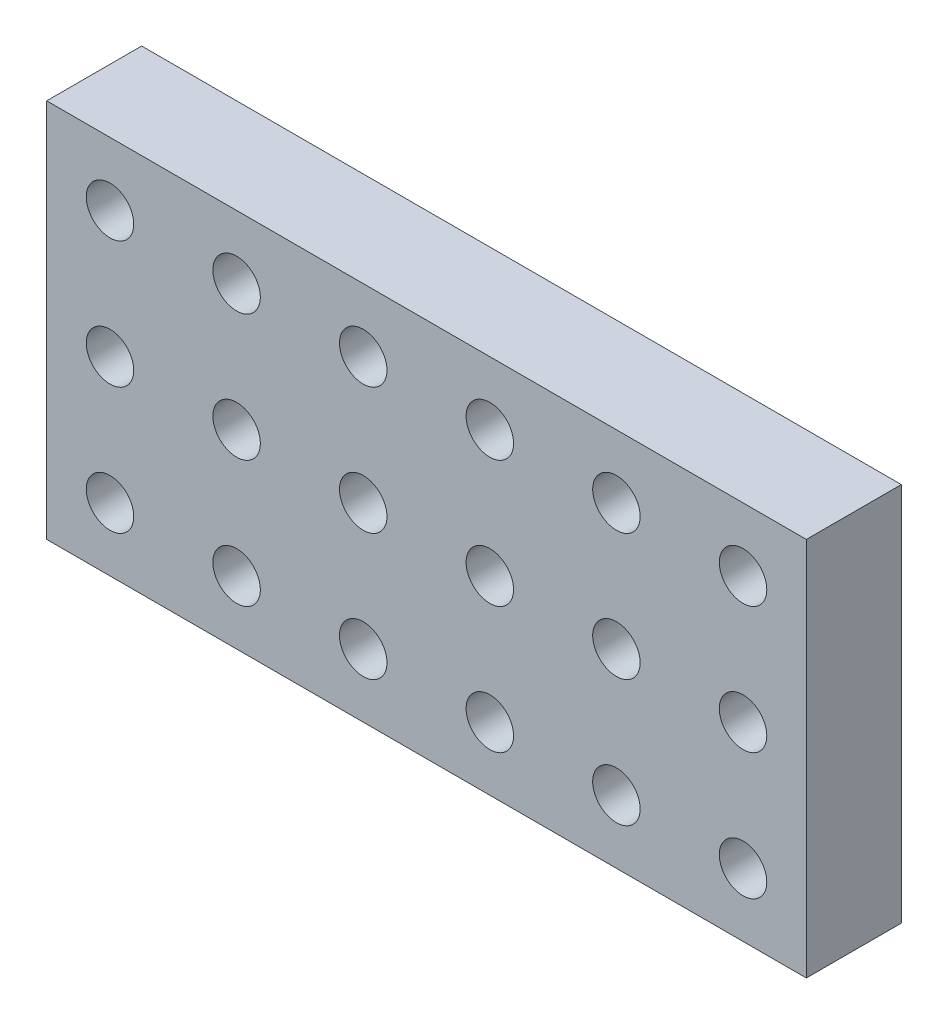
ISO-10303-21;
HEADER;
FILE_DESCRIPTION(('STEP AP214'),'2;1');
FILE_NAME('part.step','',(''),(''),'','','');
FILE_SCHEMA(('AUTOMOTIVE_DESIGN { 1 0 10303 214 1 1 1 1 }'));
ENDSEC;
DATA;
#1=APPLICATION_CONTEXT('core data for automotive mechanical design processes');
#2=APPLICATION_PROTOCOL_DEFINITION('international standard','automotive_design',2000,#1);
#3=PRODUCT_CONTEXT('',#1,'mechanical');
#4=PRODUCT('Part','Part','',(#3));
#5=PRODUCT_RELATED_PRODUCT_CATEGORY('part','',(#4));
#6=PRODUCT_DEFINITION_FORMATION('','',#4);
#7=PRODUCT_DEFINITION_CONTEXT('part definition',#1,'design');
#8=PRODUCT_DEFINITION('design','',#6,#7);
#9=PRODUCT_DEFINITION_SHAPE('','',#8);
#10=(LENGTH_UNIT() NAMED_UNIT(*) SI_UNIT(.MILLI.,.METRE.));
#11=(NAMED_UNIT(*) PLANE_ANGLE_UNIT() SI_UNIT($,.RADIAN.));
#12=(NAMED_UNIT(*) SI_UNIT($,.STERADIAN.) SOLID_ANGLE_UNIT());
#13=UNCERTAINTY_MEASURE_WITH_UNIT(LENGTH_MEASURE(1.E-05),#10,'distance_accuracy_value','');
#14=(GEOMETRIC_REPRESENTATION_CONTEXT(3) GLOBAL_UNCERTAINTY_ASSIGNED_CONTEXT((#13)) GLOBAL_UNIT_ASSIGNED_CONTEXT((#10,
#11,#12)) REPRESENTATION_CONTEXT('',''));
#15=CARTESIAN_POINT('',(0.,0.,0.));
#16=DIRECTION('',(0.,0.,1.));
#17=DIRECTION('',(1.,0.,0.));
#18=AXIS2_PLACEMENT_3D('',#15,#16,#17);
#19=CARTESIAN_POINT('',(-120.,-60.,30.));
#20=DIRECTION('',(1.,0.,0.));
#21=DIRECTION('',(0.,0.,-1.));
#22=AXIS2_PLACEMENT_3D('',#19,#20,#21);
#23=PLANE('',#22);
#24=DIRECTION('',(0.,-1.,0.));
#25=VECTOR('',#24,1.);
#26=CARTESIAN_POINT('',(-120.,-60.,0.));
#27=LINE('',#26,#25);
#28=CARTESIAN_POINT('',(-120.,60.,0.));
#29=VERTEX_POINT('',#28);
#30=CARTESIAN_POINT('',(-120.,-60.,0.));
#31=VERTEX_POINT('',#30);
#32=EDGE_CURVE('E392',#29,#31,#27,.T.);
#33=ORIENTED_EDGE('',*,*,#32,.T.);
#34=DIRECTION('',(0.,0.,-1.));
#35=VECTOR('',#34,1.);
#36=CARTESIAN_POINT('',(-120.,-60.,30.));
#37=LINE('',#36,#35);
#38=CARTESIAN_POINT('',(-120.,-60.,30.));
#39=VERTEX_POINT('',#38);
#40=EDGE_CURVE('E11',#39,#31,#37,.T.);
#41=ORIENTED_EDGE('',*,*,#40,.F.);
#42=DIRECTION('',(0.,-1.,0.));
#43=VECTOR('',#42,1.);
#44=CARTESIAN_POINT('',(-120.,-60.,30.));
#45=LINE('',#44,#43);
#46=CARTESIAN_POINT('',(-120.,60.,30.));
#47=VERTEX_POINT('',#46);
#48=EDGE_CURVE('E415',#47,#39,#45,.T.);
#49=ORIENTED_EDGE('',*,*,#48,.F.);
#50=DIRECTION('',(0.,0.,-1.));
#51=VECTOR('',#50,1.);
#52=CARTESIAN_POINT('',(-120.,60.,30.));
#53=LINE('',#52,#51);
#54=EDGE_CURVE('E404',#47,#29,#53,.T.);
#55=ORIENTED_EDGE('',*,*,#54,.T.);
#56=EDGE_LOOP('',(#33,#41,#49,#55));
#57=FACE_BOUND('',#56,.T.);
#58=ADVANCED_FACE('F348',(#57),#23,.F.);
#59=CARTESIAN_POINT('',(-120.,-60.,30.));
#60=DIRECTION('',(0.,1.,0.));
#61=DIRECTION('',(0.,0.,1.));
#62=AXIS2_PLACEMENT_3D('',#59,#60,#61);
#63=PLANE('',#62);
#64=DIRECTION('',(1.,0.,0.));
#65=VECTOR('',#64,1.);
#66=CARTESIAN_POINT('',(-120.,-60.,0.));
#67=LINE('',#66,#65);
#68=CARTESIAN_POINT('',(120.,-60.,0.));
#69=VERTEX_POINT('',#68);
#70=EDGE_CURVE('E388',#31,#69,#67,.T.);
#71=ORIENTED_EDGE('',*,*,#70,.T.);
#72=DIRECTION('',(0.,0.,-1.));
#73=VECTOR('',#72,1.);
#74=CARTESIAN_POINT('',(120.,-60.,30.));
#75=LINE('',#74,#73);
#76=CARTESIAN_POINT('',(120.,-60.,30.));
#77=VERTEX_POINT('',#76);
#78=EDGE_CURVE('E355',#77,#69,#75,.T.);
#79=ORIENTED_EDGE('',*,*,#78,.F.);
#80=DIRECTION('',(1.,0.,0.));
#81=VECTOR('',#80,1.);
#82=CARTESIAN_POINT('',(-120.,-60.,30.));
#83=LINE('',#82,#81);
#84=EDGE_CURVE('E400',#39,#77,#83,.T.);
#85=ORIENTED_EDGE('',*,*,#84,.F.);
#86=ORIENTED_EDGE('',*,*,#40,.T.);
#87=EDGE_LOOP('',(#71,#79,#85,#86));
#88=FACE_BOUND('',#87,.T.);
#89=ADVANCED_FACE('F399',(#88),#63,.F.);
#90=CARTESIAN_POINT('',(120.,-60.,30.));
#91=DIRECTION('',(-1.,0.,0.));
#92=DIRECTION('',(0.,0.,1.));
#93=AXIS2_PLACEMENT_3D('',#90,#91,#92);
#94=PLANE('',#93);
#95=DIRECTION('',(0.,1.,0.));
#96=VECTOR('',#95,1.);
#97=CARTESIAN_POINT('',(120.,-60.,0.));
#98=LINE('',#97,#96);
#99=CARTESIAN_POINT('',(120.,60.,0.));
#100=VERTEX_POINT('',#99);
#101=EDGE_CURVE('E393',#69,#100,#98,.T.);
#102=ORIENTED_EDGE('',*,*,#101,.T.);
#103=DIRECTION('',(0.,0.,-1.));
#104=VECTOR('',#103,1.);
#105=CARTESIAN_POINT('',(120.,60.,30.));
#106=LINE('',#105,#104);
#107=CARTESIAN_POINT('',(120.,60.,30.));
#108=VERTEX_POINT('',#107);
#109=EDGE_CURVE('E421',#108,#100,#106,.T.);
#110=ORIENTED_EDGE('',*,*,#109,.F.);
#111=DIRECTION('',(0.,1.,0.));
#112=VECTOR('',#111,1.);
#113=CARTESIAN_POINT('',(120.,-60.,30.));
#114=LINE('',#113,#112);
#115=EDGE_CURVE('E367',#77,#108,#114,.T.);
#116=ORIENTED_EDGE('',*,*,#115,.F.);
#117=ORIENTED_EDGE('',*,*,#78,.T.);
#118=EDGE_LOOP('',(#102,#110,#116,#117));
#119=FACE_BOUND('',#118,.T.);
#120=ADVANCED_FACE('F424',(#119),#94,.F.);
#121=CARTESIAN_POINT('',(-120.,60.,30.));
#122=DIRECTION('',(0.,-1.,0.));
#123=DIRECTION('',(0.,0.,-1.));
#124=AXIS2_PLACEMENT_3D('',#121,#122,#123);
#125=PLANE('',#124);
#126=DIRECTION('',(-1.,0.,0.));
#127=VECTOR('',#126,1.);
#128=CARTESIAN_POINT('',(-120.,60.,0.));
#129=LINE('',#128,#127);
#130=EDGE_CURVE('E413',#100,#29,#129,.T.);
#131=ORIENTED_EDGE('',*,*,#130,.T.);
#132=ORIENTED_EDGE('',*,*,#54,.F.);
#133=DIRECTION('',(-1.,0.,0.));
#134=VECTOR('',#133,1.);
#135=CARTESIAN_POINT('',(-120.,60.,30.));
#136=LINE('',#135,#134);
#137=EDGE_CURVE('E362',#108,#47,#136,.T.);
#138=ORIENTED_EDGE('',*,*,#137,.F.);
#139=ORIENTED_EDGE('',*,*,#109,.T.);
#140=EDGE_LOOP('',(#131,#132,#138,#139));
#141=FACE_BOUND('',#140,.T.);
#142=ADVANCED_FACE('F426',(#141),#125,.F.);
#143=CARTESIAN_POINT('',(-120.,60.,30.));
#144=DIRECTION('',(0.,0.,-1.));
#145=DIRECTION('',(-1.,0.,0.));
#146=AXIS2_PLACEMENT_3D('',#143,#144,#145);
#147=PLANE('',#146);
#148=CARTESIAN_POINT('',(100.000000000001,-40.,30.));
#149=DIRECTION('',(0.,0.,1.));
#150=DIRECTION('',(1.,0.,0.));
#151=AXIS2_PLACEMENT_3D('',#148,#149,#150);
#152=CIRCLE('',#151,7.50000000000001);
#153=CARTESIAN_POINT('',(107.500000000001,-40.,30.));
#154=VERTEX_POINT('',#153);
#155=EDGE_CURVE('E611',#154,#154,#152,.T.);
#156=ORIENTED_EDGE('',*,*,#155,.F.);
#157=EDGE_LOOP('',(#156));
#158=FACE_BOUND('',#157,.T.);
#159=CARTESIAN_POINT('',(60.0000000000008,-40.,30.));
#160=DIRECTION('',(0.,0.,1.));
#161=DIRECTION('',(1.,0.,0.));
#162=AXIS2_PLACEMENT_3D('',#159,#160,#161);
#163=CIRCLE('',#162,7.50000000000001);
#164=CARTESIAN_POINT('',(67.5000000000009,-40.,30.));
#165=VERTEX_POINT('',#164);
#166=EDGE_CURVE('E615',#165,#165,#163,.T.);
#167=ORIENTED_EDGE('',*,*,#166,.F.);
#168=EDGE_LOOP('',(#167));
#169=FACE_BOUND('',#168,.T.);
#170=CARTESIAN_POINT('',(20.0000000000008,-40.,30.));
#171=DIRECTION('',(0.,0.,1.));
#172=DIRECTION('',(1.,0.,0.));
#173=AXIS2_PLACEMENT_3D('',#170,#171,#172);
#174=CIRCLE('',#173,7.50000000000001);
#175=CARTESIAN_POINT('',(27.5000000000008,-40.,30.));
#176=VERTEX_POINT('',#175);
#177=EDGE_CURVE('E622',#176,#176,#174,.T.);
#178=ORIENTED_EDGE('',*,*,#177,.F.);
#179=EDGE_LOOP('',(#178));
#180=FACE_BOUND('',#179,.T.);
#181=CARTESIAN_POINT('',(-19.9999999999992,-40.,30.));
#182=DIRECTION('',(0.,0.,1.));
#183=DIRECTION('',(1.,0.,0.));
#184=AXIS2_PLACEMENT_3D('',#181,#182,#183);
#185=CIRCLE('',#184,7.50000000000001);
#186=CARTESIAN_POINT('',(-12.4999999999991,-40.,30.));
#187=VERTEX_POINT('',#186);
#188=EDGE_CURVE('E628',#187,#187,#185,.T.);
#189=ORIENTED_EDGE('',*,*,#188,.F.);
#190=EDGE_LOOP('',(#189));
#191=FACE_BOUND('',#190,.T.);
#192=CARTESIAN_POINT('',(-59.9999999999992,-40.,30.));
#193=DIRECTION('',(0.,0.,1.));
#194=DIRECTION('',(1.,0.,0.));
#195=AXIS2_PLACEMENT_3D('',#192,#193,#194);
#196=CIRCLE('',#195,7.50000000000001);
#197=CARTESIAN_POINT('',(-52.4999999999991,-40.,30.));
#198=VERTEX_POINT('',#197);
#199=EDGE_CURVE('E634',#198,#198,#196,.T.);
#200=ORIENTED_EDGE('',*,*,#199,.F.);
#201=EDGE_LOOP('',(#200));
#202=FACE_BOUND('',#201,.T.);
#203=CARTESIAN_POINT('',(-99.9999999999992,-40.,30.));
#204=DIRECTION('',(0.,0.,1.));
#205=DIRECTION('',(1.,0.,0.));
#206=AXIS2_PLACEMENT_3D('',#203,#204,#205);
#207=CIRCLE('',#206,7.50000000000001);
#208=CARTESIAN_POINT('',(-92.4999999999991,-40.,30.));
#209=VERTEX_POINT('',#208);
#210=EDGE_CURVE('E640',#209,#209,#207,.T.);
#211=ORIENTED_EDGE('',*,*,#210,.F.);
#212=EDGE_LOOP('',(#211));
#213=FACE_BOUND('',#212,.T.);
#214=CARTESIAN_POINT('',(100.,0.,30.));
#215=DIRECTION('',(0.,0.,1.));
#216=DIRECTION('',(1.,0.,0.));
#217=AXIS2_PLACEMENT_3D('',#214,#215,#216);
#218=CIRCLE('',#217,7.50000000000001);
#219=CARTESIAN_POINT('',(107.5,0.,30.));
#220=VERTEX_POINT('',#219);
#221=EDGE_CURVE('E646',#220,#220,#218,.T.);
#222=ORIENTED_EDGE('',*,*,#221,.F.);
#223=EDGE_LOOP('',(#222));
#224=FACE_BOUND('',#223,.T.);
#225=CARTESIAN_POINT('',(60.0000000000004,0.,30.));
#226=DIRECTION('',(0.,0.,1.));
#227=DIRECTION('',(1.,0.,0.));
#228=AXIS2_PLACEMENT_3D('',#225,#226,#227);
#229=CIRCLE('',#228,7.50000000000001);
#230=CARTESIAN_POINT('',(67.5000000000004,0.,30.));
#231=VERTEX_POINT('',#230);
#232=EDGE_CURVE('E652',#231,#231,#229,.T.);
#233=ORIENTED_EDGE('',*,*,#232,.F.);
#234=EDGE_LOOP('',(#233));
#235=FACE_BOUND('',#234,.T.);
#236=CARTESIAN_POINT('',(20.0000000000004,0.,30.));
#237=DIRECTION('',(0.,0.,1.));
#238=DIRECTION('',(1.,0.,0.));
#239=AXIS2_PLACEMENT_3D('',#236,#237,#238);
#240=CIRCLE('',#239,7.50000000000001);
#241=CARTESIAN_POINT('',(27.5000000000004,0.,30.));
#242=VERTEX_POINT('',#241);
#243=EDGE_CURVE('E658',#242,#242,#240,.T.);
#244=ORIENTED_EDGE('',*,*,#243,.F.);
#245=EDGE_LOOP('',(#244));
#246=FACE_BOUND('',#245,.T.);
#247=CARTESIAN_POINT('',(-19.9999999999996,0.,30.));
#248=DIRECTION('',(0.,0.,1.));
#249=DIRECTION('',(1.,0.,0.));
#250=AXIS2_PLACEMENT_3D('',#247,#248,#249);
#251=CIRCLE('',#250,7.50000000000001);
#252=CARTESIAN_POINT('',(-12.4999999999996,0.,30.));
#253=VERTEX_POINT('',#252);
#254=EDGE_CURVE('E664',#253,#253,#251,.T.);
#255=ORIENTED_EDGE('',*,*,#254,.F.);
#256=EDGE_LOOP('',(#255));
#257=FACE_BOUND('',#256,.T.);
#258=CARTESIAN_POINT('',(-59.9999999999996,0.,30.));
#259=DIRECTION('',(0.,0.,1.));
#260=DIRECTION('',(1.,0.,0.));
#261=AXIS2_PLACEMENT_3D('',#258,#259,#260);
#262=CIRCLE('',#261,7.50000000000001);
#263=CARTESIAN_POINT('',(-52.4999999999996,0.,30.));
#264=VERTEX_POINT('',#263);
#265=EDGE_CURVE('E670',#264,#264,#262,.T.);
#266=ORIENTED_EDGE('',*,*,#265,.F.);
#267=EDGE_LOOP('',(#266));
#268=FACE_BOUND('',#267,.T.);
#269=CARTESIAN_POINT('',(-99.9999999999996,0.,30.));
#270=DIRECTION('',(0.,0.,1.));
#271=DIRECTION('',(1.,0.,0.));
#272=AXIS2_PLACEMENT_3D('',#269,#270,#271);
#273=CIRCLE('',#272,7.50000000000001);
#274=CARTESIAN_POINT('',(-92.4999999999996,0.,30.));
#275=VERTEX_POINT('',#274);
#276=EDGE_CURVE('E676',#275,#275,#273,.T.);
#277=ORIENTED_EDGE('',*,*,#276,.F.);
#278=EDGE_LOOP('',(#277));
#279=FACE_BOUND('',#278,.T.);
#280=CARTESIAN_POINT('',(100.,40.,30.));
#281=DIRECTION('',(0.,0.,1.));
#282=DIRECTION('',(1.,0.,0.));
#283=AXIS2_PLACEMENT_3D('',#280,#281,#282);
#284=CIRCLE('',#283,7.50000000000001);
#285=CARTESIAN_POINT('',(107.5,40.,30.));
#286=VERTEX_POINT('',#285);
#287=EDGE_CURVE('E682',#286,#286,#284,.T.);
#288=ORIENTED_EDGE('',*,*,#287,.F.);
#289=EDGE_LOOP('',(#288));
#290=FACE_BOUND('',#289,.T.);
#291=CARTESIAN_POINT('',(60.,40.,30.));
#292=DIRECTION('',(0.,0.,1.));
#293=DIRECTION('',(1.,0.,0.));
#294=AXIS2_PLACEMENT_3D('',#291,#292,#293);
#295=CIRCLE('',#294,7.50000000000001);
#296=CARTESIAN_POINT('',(67.5,40.,30.));
#297=VERTEX_POINT('',#296);
#298=EDGE_CURVE('E688',#297,#297,#295,.T.);
#299=ORIENTED_EDGE('',*,*,#298,.F.);
#300=EDGE_LOOP('',(#299));
#301=FACE_BOUND('',#300,.T.);
#302=CARTESIAN_POINT('',(20.,40.,30.));
#303=DIRECTION('',(0.,0.,1.));
#304=DIRECTION('',(1.,0.,0.));
#305=AXIS2_PLACEMENT_3D('',#302,#303,#304);
#306=CIRCLE('',#305,7.50000000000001);
#307=CARTESIAN_POINT('',(27.5,40.,30.));
#308=VERTEX_POINT('',#307);
#309=EDGE_CURVE('E694',#308,#308,#306,.T.);
#310=ORIENTED_EDGE('',*,*,#309,.F.);
#311=EDGE_LOOP('',(#310));
#312=FACE_BOUND('',#311,.T.);
#313=CARTESIAN_POINT('',(-20.,40.,30.));
#314=DIRECTION('',(0.,0.,1.));
#315=DIRECTION('',(1.,0.,0.));
#316=AXIS2_PLACEMENT_3D('',#313,#314,#315);
#317=CIRCLE('',#316,7.50000000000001);
#318=CARTESIAN_POINT('',(-12.5,40.,30.));
#319=VERTEX_POINT('',#318);
#320=EDGE_CURVE('E700',#319,#319,#317,.T.);
#321=ORIENTED_EDGE('',*,*,#320,.F.);
#322=EDGE_LOOP('',(#321));
#323=FACE_BOUND('',#322,.T.);
#324=CARTESIAN_POINT('',(-60.,40.,30.));
#325=DIRECTION('',(0.,0.,1.));
#326=DIRECTION('',(1.,0.,0.));
#327=AXIS2_PLACEMENT_3D('',#324,#325,#326);
#328=CIRCLE('',#327,7.50000000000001);
#329=CARTESIAN_POINT('',(-52.5,40.,30.));
#330=VERTEX_POINT('',#329);
#331=EDGE_CURVE('E706',#330,#330,#328,.T.);
#332=ORIENTED_EDGE('',*,*,#331,.F.);
#333=EDGE_LOOP('',(#332));
#334=FACE_BOUND('',#333,.T.);
#335=CARTESIAN_POINT('',(-100.,40.,30.));
#336=DIRECTION('',(0.,0.,1.));
#337=DIRECTION('',(1.,0.,0.));
#338=AXIS2_PLACEMENT_3D('',#335,#336,#337);
#339=CIRCLE('',#338,7.50000000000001);
#340=CARTESIAN_POINT('',(-92.5,40.,30.));
#341=VERTEX_POINT('',#340);
#342=EDGE_CURVE('E405',#341,#341,#339,.T.);
#343=ORIENTED_EDGE('',*,*,#342,.F.);
#344=EDGE_LOOP('',(#343));
#345=FACE_BOUND('',#344,.T.);
#346=ORIENTED_EDGE('',*,*,#48,.T.);
#347=ORIENTED_EDGE('',*,*,#84,.T.);
#348=ORIENTED_EDGE('',*,*,#115,.T.);
#349=ORIENTED_EDGE('',*,*,#137,.T.);
#350=EDGE_LOOP('',(#346,#347,#348,#349));
#351=FACE_BOUND('',#350,.T.);
#352=ADVANCED_FACE('F427',(#158,#169,#180,#191,#202,#213,#224,#235,#246,#257,#268,#279,#290,
#301,#312,#323,#334,#345,#351),#147,.F.);
#353=CARTESIAN_POINT('',(-120.,60.,0.));
#354=DIRECTION('',(0.,0.,-1.));
#355=DIRECTION('',(-1.,0.,0.));
#356=AXIS2_PLACEMENT_3D('',#353,#354,#355);
#357=PLANE('',#356);
#358=CARTESIAN_POINT('',(100.000000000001,-40.,0.));
#359=DIRECTION('',(0.,0.,-1.));
#360=DIRECTION('',(-1.,0.,0.));
#361=AXIS2_PLACEMENT_3D('',#358,#359,#360);
#362=CIRCLE('',#361,7.50000000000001);
#363=CARTESIAN_POINT('',(92.5000000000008,-40.,0.));
#364=VERTEX_POINT('',#363);
#365=EDGE_CURVE('E609',#364,#364,#362,.F.);
#366=ORIENTED_EDGE('',*,*,#365,.T.);
#367=EDGE_LOOP('',(#366));
#368=FACE_BOUND('',#367,.T.);
#369=CARTESIAN_POINT('',(60.0000000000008,-40.,0.));
#370=DIRECTION('',(0.,0.,-1.));
#371=DIRECTION('',(-1.,0.,0.));
#372=AXIS2_PLACEMENT_3D('',#369,#370,#371);
#373=CIRCLE('',#372,7.50000000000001);
#374=CARTESIAN_POINT('',(52.5000000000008,-40.,0.));
#375=VERTEX_POINT('',#374);
#376=EDGE_CURVE('E612',#375,#375,#373,.F.);
#377=ORIENTED_EDGE('',*,*,#376,.T.);
#378=EDGE_LOOP('',(#377));
#379=FACE_BOUND('',#378,.T.);
#380=CARTESIAN_POINT('',(20.0000000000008,-40.,0.));
#381=DIRECTION('',(0.,0.,-1.));
#382=DIRECTION('',(-1.,0.,0.));
#383=AXIS2_PLACEMENT_3D('',#380,#381,#382);
#384=CIRCLE('',#383,7.50000000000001);
#385=CARTESIAN_POINT('',(12.5000000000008,-40.,0.));
#386=VERTEX_POINT('',#385);
#387=EDGE_CURVE('E620',#386,#386,#384,.F.);
#388=ORIENTED_EDGE('',*,*,#387,.T.);
#389=EDGE_LOOP('',(#388));
#390=FACE_BOUND('',#389,.T.);
#391=CARTESIAN_POINT('',(-19.9999999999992,-40.,0.));
#392=DIRECTION('',(0.,0.,-1.));
#393=DIRECTION('',(-1.,0.,0.));
#394=AXIS2_PLACEMENT_3D('',#391,#392,#393);
#395=CIRCLE('',#394,7.50000000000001);
#396=CARTESIAN_POINT('',(-27.4999999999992,-40.,0.));
#397=VERTEX_POINT('',#396);
#398=EDGE_CURVE('E625',#397,#397,#395,.F.);
#399=ORIENTED_EDGE('',*,*,#398,.T.);
#400=EDGE_LOOP('',(#399));
#401=FACE_BOUND('',#400,.T.);
#402=CARTESIAN_POINT('',(-59.9999999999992,-40.,0.));
#403=DIRECTION('',(0.,0.,-1.));
#404=DIRECTION('',(-1.,0.,0.));
#405=AXIS2_PLACEMENT_3D('',#402,#403,#404);
#406=CIRCLE('',#405,7.50000000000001);
#407=CARTESIAN_POINT('',(-67.4999999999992,-40.,0.));
#408=VERTEX_POINT('',#407);
#409=EDGE_CURVE('E631',#408,#408,#406,.F.);
#410=ORIENTED_EDGE('',*,*,#409,.T.);
#411=EDGE_LOOP('',(#410));
#412=FACE_BOUND('',#411,.T.);
#413=CARTESIAN_POINT('',(-99.9999999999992,-40.,0.));
#414=DIRECTION('',(0.,0.,-1.));
#415=DIRECTION('',(-1.,0.,0.));
#416=AXIS2_PLACEMENT_3D('',#413,#414,#415);
#417=CIRCLE('',#416,7.50000000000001);
#418=CARTESIAN_POINT('',(-107.499999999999,-40.,0.));
#419=VERTEX_POINT('',#418);
#420=EDGE_CURVE('E637',#419,#419,#417,.F.);
#421=ORIENTED_EDGE('',*,*,#420,.T.);
#422=EDGE_LOOP('',(#421));
#423=FACE_BOUND('',#422,.T.);
#424=CARTESIAN_POINT('',(100.,0.,0.));
#425=DIRECTION('',(0.,0.,-1.));
#426=DIRECTION('',(-1.,0.,0.));
#427=AXIS2_PLACEMENT_3D('',#424,#425,#426);
#428=CIRCLE('',#427,7.50000000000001);
#429=CARTESIAN_POINT('',(92.5000000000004,0.,0.));
#430=VERTEX_POINT('',#429);
#431=EDGE_CURVE('E643',#430,#430,#428,.F.);
#432=ORIENTED_EDGE('',*,*,#431,.T.);
#433=EDGE_LOOP('',(#432));
#434=FACE_BOUND('',#433,.T.);
#435=CARTESIAN_POINT('',(60.0000000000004,0.,0.));
#436=DIRECTION('',(0.,0.,-1.));
#437=DIRECTION('',(-1.,0.,0.));
#438=AXIS2_PLACEMENT_3D('',#435,#436,#437);
#439=CIRCLE('',#438,7.50000000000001);
#440=CARTESIAN_POINT('',(52.5000000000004,0.,0.));
#441=VERTEX_POINT('',#440);
#442=EDGE_CURVE('E649',#441,#441,#439,.F.);
#443=ORIENTED_EDGE('',*,*,#442,.T.);
#444=EDGE_LOOP('',(#443));
#445=FACE_BOUND('',#444,.T.);
#446=CARTESIAN_POINT('',(20.0000000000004,0.,0.));
#447=DIRECTION('',(0.,0.,-1.));
#448=DIRECTION('',(-1.,0.,0.));
#449=AXIS2_PLACEMENT_3D('',#446,#447,#448);
#450=CIRCLE('',#449,7.50000000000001);
#451=CARTESIAN_POINT('',(12.5000000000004,0.,0.));
#452=VERTEX_POINT('',#451);
#453=EDGE_CURVE('E655',#452,#452,#450,.F.);
#454=ORIENTED_EDGE('',*,*,#453,.T.);
#455=EDGE_LOOP('',(#454));
#456=FACE_BOUND('',#455,.T.);
#457=CARTESIAN_POINT('',(-19.9999999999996,0.,0.));
#458=DIRECTION('',(0.,0.,-1.));
#459=DIRECTION('',(-1.,0.,0.));
#460=AXIS2_PLACEMENT_3D('',#457,#458,#459);
#461=CIRCLE('',#460,7.50000000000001);
#462=CARTESIAN_POINT('',(-27.4999999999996,0.,0.));
#463=VERTEX_POINT('',#462);
#464=EDGE_CURVE('E661',#463,#463,#461,.F.);
#465=ORIENTED_EDGE('',*,*,#464,.T.);
#466=EDGE_LOOP('',(#465));
#467=FACE_BOUND('',#466,.T.);
#468=CARTESIAN_POINT('',(-59.9999999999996,0.,0.));
#469=DIRECTION('',(0.,0.,-1.));
#470=DIRECTION('',(-1.,0.,0.));
#471=AXIS2_PLACEMENT_3D('',#468,#469,#470);
#472=CIRCLE('',#471,7.50000000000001);
#473=CARTESIAN_POINT('',(-67.4999999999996,0.,0.));
#474=VERTEX_POINT('',#473);
#475=EDGE_CURVE('E667',#474,#474,#472,.F.);
#476=ORIENTED_EDGE('',*,*,#475,.T.);
#477=EDGE_LOOP('',(#476));
#478=FACE_BOUND('',#477,.T.);
#479=CARTESIAN_POINT('',(-99.9999999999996,0.,0.));
#480=DIRECTION('',(0.,0.,-1.));
#481=DIRECTION('',(-1.,0.,0.));
#482=AXIS2_PLACEMENT_3D('',#479,#480,#481);
#483=CIRCLE('',#482,7.50000000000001);
#484=CARTESIAN_POINT('',(-107.5,0.,0.));
#485=VERTEX_POINT('',#484);
#486=EDGE_CURVE('E673',#485,#485,#483,.F.);
#487=ORIENTED_EDGE('',*,*,#486,.T.);
#488=EDGE_LOOP('',(#487));
#489=FACE_BOUND('',#488,.T.);
#490=CARTESIAN_POINT('',(100.,40.,0.));
#491=DIRECTION('',(0.,0.,-1.));
#492=DIRECTION('',(-1.,0.,0.));
#493=AXIS2_PLACEMENT_3D('',#490,#491,#492);
#494=CIRCLE('',#493,7.50000000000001);
#495=CARTESIAN_POINT('',(92.5,40.,0.));
#496=VERTEX_POINT('',#495);
#497=EDGE_CURVE('E679',#496,#496,#494,.F.);
#498=ORIENTED_EDGE('',*,*,#497,.T.);
#499=EDGE_LOOP('',(#498));
#500=FACE_BOUND('',#499,.T.);
#501=CARTESIAN_POINT('',(60.,40.,0.));
#502=DIRECTION('',(0.,0.,-1.));
#503=DIRECTION('',(-1.,0.,0.));
#504=AXIS2_PLACEMENT_3D('',#501,#502,#503);
#505=CIRCLE('',#504,7.50000000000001);
#506=CARTESIAN_POINT('',(52.5,40.,0.));
#507=VERTEX_POINT('',#506);
#508=EDGE_CURVE('E685',#507,#507,#505,.F.);
#509=ORIENTED_EDGE('',*,*,#508,.T.);
#510=EDGE_LOOP('',(#509));
#511=FACE_BOUND('',#510,.T.);
#512=CARTESIAN_POINT('',(20.,40.,0.));
#513=DIRECTION('',(0.,0.,-1.));
#514=DIRECTION('',(-1.,0.,0.));
#515=AXIS2_PLACEMENT_3D('',#512,#513,#514);
#516=CIRCLE('',#515,7.50000000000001);
#517=CARTESIAN_POINT('',(12.5,40.,0.));
#518=VERTEX_POINT('',#517);
#519=EDGE_CURVE('E691',#518,#518,#516,.F.);
#520=ORIENTED_EDGE('',*,*,#519,.T.);
#521=EDGE_LOOP('',(#520));
#522=FACE_BOUND('',#521,.T.);
#523=CARTESIAN_POINT('',(-20.,40.,0.));
#524=DIRECTION('',(0.,0.,-1.));
#525=DIRECTION('',(-1.,0.,0.));
#526=AXIS2_PLACEMENT_3D('',#523,#524,#525);
#527=CIRCLE('',#526,7.50000000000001);
#528=CARTESIAN_POINT('',(-27.5,40.,0.));
#529=VERTEX_POINT('',#528);
#530=EDGE_CURVE('E697',#529,#529,#527,.F.);
#531=ORIENTED_EDGE('',*,*,#530,.T.);
#532=EDGE_LOOP('',(#531));
#533=FACE_BOUND('',#532,.T.);
#534=CARTESIAN_POINT('',(-60.,40.,0.));
#535=DIRECTION('',(0.,0.,-1.));
#536=DIRECTION('',(-1.,0.,0.));
#537=AXIS2_PLACEMENT_3D('',#534,#535,#536);
#538=CIRCLE('',#537,7.50000000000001);
#539=CARTESIAN_POINT('',(-67.5,40.,0.));
#540=VERTEX_POINT('',#539);
#541=EDGE_CURVE('E703',#540,#540,#538,.F.);
#542=ORIENTED_EDGE('',*,*,#541,.T.);
#543=EDGE_LOOP('',(#542));
#544=FACE_BOUND('',#543,.T.);
#545=CARTESIAN_POINT('',(-100.,40.,0.));
#546=DIRECTION('',(0.,0.,-1.));
#547=DIRECTION('',(-1.,0.,0.));
#548=AXIS2_PLACEMENT_3D('',#545,#546,#547);
#549=CIRCLE('',#548,7.50000000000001);
#550=CARTESIAN_POINT('',(-107.5,40.,0.));
#551=VERTEX_POINT('',#550);
#552=EDGE_CURVE('E408',#551,#551,#549,.F.);
#553=ORIENTED_EDGE('',*,*,#552,.T.);
#554=EDGE_LOOP('',(#553));
#555=FACE_BOUND('',#554,.T.);
#556=ORIENTED_EDGE('',*,*,#32,.F.);
#557=ORIENTED_EDGE('',*,*,#130,.F.);
#558=ORIENTED_EDGE('',*,*,#101,.F.);
#559=ORIENTED_EDGE('',*,*,#70,.F.);
#560=EDGE_LOOP('',(#556,#557,#558,#559));
#561=FACE_BOUND('',#560,.T.);
#562=ADVANCED_FACE('F389',(#368,#379,#390,#401,#412,#423,#434,#445,#456,#467,#478,#489,#500,
#511,#522,#533,#544,#555,#561),#357,.T.);
#563=CARTESIAN_POINT('',(-100.,40.,-0.001000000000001));
#564=DIRECTION('',(0.,0.,1.));
#565=DIRECTION('',(1.,0.,0.));
#566=AXIS2_PLACEMENT_3D('',#563,#564,#565);
#567=CYLINDRICAL_SURFACE('',#566,7.50000000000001);
#568=ORIENTED_EDGE('',*,*,#552,.F.);
#569=EDGE_LOOP('',(#568));
#570=FACE_BOUND('',#569,.T.);
#571=ORIENTED_EDGE('',*,*,#342,.T.);
#572=EDGE_LOOP('',(#571));
#573=FACE_BOUND('',#572,.T.);
#574=ADVANCED_FACE('F435',(#570,#573),#567,.F.);
#575=CARTESIAN_POINT('',(-60.,40.,-0.001000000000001));
#576=DIRECTION('',(0.,0.,1.));
#577=DIRECTION('',(1.,0.,0.));
#578=AXIS2_PLACEMENT_3D('',#575,#576,#577);
#579=CYLINDRICAL_SURFACE('',#578,7.50000000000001);
#580=ORIENTED_EDGE('',*,*,#541,.F.);
#581=EDGE_LOOP('',(#580));
#582=FACE_BOUND('',#581,.T.);
#583=ORIENTED_EDGE('',*,*,#331,.T.);
#584=EDGE_LOOP('',(#583));
#585=FACE_BOUND('',#584,.T.);
#586=ADVANCED_FACE('F468',(#582,#585),#579,.F.);
#587=CARTESIAN_POINT('',(-20.,40.,-0.001000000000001));
#588=DIRECTION('',(0.,0.,1.));
#589=DIRECTION('',(1.,0.,0.));
#590=AXIS2_PLACEMENT_3D('',#587,#588,#589);
#591=CYLINDRICAL_SURFACE('',#590,7.50000000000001);
#592=ORIENTED_EDGE('',*,*,#530,.F.);
#593=EDGE_LOOP('',(#592));
#594=FACE_BOUND('',#593,.T.);
#595=ORIENTED_EDGE('',*,*,#320,.T.);
#596=EDGE_LOOP('',(#595));
#597=FACE_BOUND('',#596,.T.);
#598=ADVANCED_FACE('F476',(#594,#597),#591,.F.);
#599=CARTESIAN_POINT('',(20.,40.,-0.001000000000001));
#600=DIRECTION('',(0.,0.,1.));
#601=DIRECTION('',(1.,0.,0.));
#602=AXIS2_PLACEMENT_3D('',#599,#600,#601);
#603=CYLINDRICAL_SURFACE('',#602,7.50000000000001);
#604=ORIENTED_EDGE('',*,*,#519,.F.);
#605=EDGE_LOOP('',(#604));
#606=FACE_BOUND('',#605,.T.);
#607=ORIENTED_EDGE('',*,*,#309,.T.);
#608=EDGE_LOOP('',(#607));
#609=FACE_BOUND('',#608,.T.);
#610=ADVANCED_FACE('F484',(#606,#609),#603,.F.);
#611=CARTESIAN_POINT('',(60.,40.,-0.001000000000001));
#612=DIRECTION('',(0.,0.,1.));
#613=DIRECTION('',(1.,0.,0.));
#614=AXIS2_PLACEMENT_3D('',#611,#612,#613);
#615=CYLINDRICAL_SURFACE('',#614,7.50000000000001);
#616=ORIENTED_EDGE('',*,*,#508,.F.);
#617=EDGE_LOOP('',(#616));
#618=FACE_BOUND('',#617,.T.);
#619=ORIENTED_EDGE('',*,*,#298,.T.);
#620=EDGE_LOOP('',(#619));
#621=FACE_BOUND('',#620,.T.);
#622=ADVANCED_FACE('F492',(#618,#621),#615,.F.);
#623=CARTESIAN_POINT('',(100.,40.,-0.001000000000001));
#624=DIRECTION('',(0.,0.,1.));
#625=DIRECTION('',(1.,0.,0.));
#626=AXIS2_PLACEMENT_3D('',#623,#624,#625);
#627=CYLINDRICAL_SURFACE('',#626,7.50000000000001);
#628=ORIENTED_EDGE('',*,*,#497,.F.);
#629=EDGE_LOOP('',(#628));
#630=FACE_BOUND('',#629,.T.);
#631=ORIENTED_EDGE('',*,*,#287,.T.);
#632=EDGE_LOOP('',(#631));
#633=FACE_BOUND('',#632,.T.);
#634=ADVANCED_FACE('F500',(#630,#633),#627,.F.);
#635=CARTESIAN_POINT('',(-99.9999999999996,0.,-0.001000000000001));
#636=DIRECTION('',(0.,0.,1.));
#637=DIRECTION('',(1.,0.,0.));
#638=AXIS2_PLACEMENT_3D('',#635,#636,#637);
#639=CYLINDRICAL_SURFACE('',#638,7.50000000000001);
#640=ORIENTED_EDGE('',*,*,#486,.F.);
#641=EDGE_LOOP('',(#640));
#642=FACE_BOUND('',#641,.T.);
#643=ORIENTED_EDGE('',*,*,#276,.T.);
#644=EDGE_LOOP('',(#643));
#645=FACE_BOUND('',#644,.T.);
#646=ADVANCED_FACE('F508',(#642,#645),#639,.F.);
#647=CARTESIAN_POINT('',(-59.9999999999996,0.,-0.001000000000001));
#648=DIRECTION('',(0.,0.,1.));
#649=DIRECTION('',(1.,0.,0.));
#650=AXIS2_PLACEMENT_3D('',#647,#648,#649);
#651=CYLINDRICAL_SURFACE('',#650,7.50000000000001);
#652=ORIENTED_EDGE('',*,*,#475,.F.);
#653=EDGE_LOOP('',(#652));
#654=FACE_BOUND('',#653,.T.);
#655=ORIENTED_EDGE('',*,*,#265,.T.);
#656=EDGE_LOOP('',(#655));
#657=FACE_BOUND('',#656,.T.);
#658=ADVANCED_FACE('F516',(#654,#657),#651,.F.);
#659=CARTESIAN_POINT('',(-19.9999999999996,0.,-0.001000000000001));
#660=DIRECTION('',(0.,0.,1.));
#661=DIRECTION('',(1.,0.,0.));
#662=AXIS2_PLACEMENT_3D('',#659,#660,#661);
#663=CYLINDRICAL_SURFACE('',#662,7.50000000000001);
#664=ORIENTED_EDGE('',*,*,#464,.F.);
#665=EDGE_LOOP('',(#664));
#666=FACE_BOUND('',#665,.T.);
#667=ORIENTED_EDGE('',*,*,#254,.T.);
#668=EDGE_LOOP('',(#667));
#669=FACE_BOUND('',#668,.T.);
#670=ADVANCED_FACE('F524',(#666,#669),#663,.F.);
#671=CARTESIAN_POINT('',(20.0000000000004,0.,-0.001000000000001));
#672=DIRECTION('',(0.,0.,1.));
#673=DIRECTION('',(1.,0.,0.));
#674=AXIS2_PLACEMENT_3D('',#671,#672,#673);
#675=CYLINDRICAL_SURFACE('',#674,7.50000000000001);
#676=ORIENTED_EDGE('',*,*,#453,.F.);
#677=EDGE_LOOP('',(#676));
#678=FACE_BOUND('',#677,.T.);
#679=ORIENTED_EDGE('',*,*,#243,.T.);
#680=EDGE_LOOP('',(#679));
#681=FACE_BOUND('',#680,.T.);
#682=ADVANCED_FACE('F532',(#678,#681),#675,.F.);
#683=CARTESIAN_POINT('',(60.0000000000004,0.,-0.001000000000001));
#684=DIRECTION('',(0.,0.,1.));
#685=DIRECTION('',(1.,0.,0.));
#686=AXIS2_PLACEMENT_3D('',#683,#684,#685);
#687=CYLINDRICAL_SURFACE('',#686,7.50000000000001);
#688=ORIENTED_EDGE('',*,*,#442,.F.);
#689=EDGE_LOOP('',(#688));
#690=FACE_BOUND('',#689,.T.);
#691=ORIENTED_EDGE('',*,*,#232,.T.);
#692=EDGE_LOOP('',(#691));
#693=FACE_BOUND('',#692,.T.);
#694=ADVANCED_FACE('F540',(#690,#693),#687,.F.);
#695=CARTESIAN_POINT('',(100.,0.,-0.001000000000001));
#696=DIRECTION('',(0.,0.,1.));
#697=DIRECTION('',(1.,0.,0.));
#698=AXIS2_PLACEMENT_3D('',#695,#696,#697);
#699=CYLINDRICAL_SURFACE('',#698,7.50000000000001);
#700=ORIENTED_EDGE('',*,*,#431,.F.);
#701=EDGE_LOOP('',(#700));
#702=FACE_BOUND('',#701,.T.);
#703=ORIENTED_EDGE('',*,*,#221,.T.);
#704=EDGE_LOOP('',(#703));
#705=FACE_BOUND('',#704,.T.);
#706=ADVANCED_FACE('F548',(#702,#705),#699,.F.);
#707=CARTESIAN_POINT('',(-99.9999999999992,-40.,-0.001000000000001));
#708=DIRECTION('',(0.,0.,1.));
#709=DIRECTION('',(1.,0.,0.));
#710=AXIS2_PLACEMENT_3D('',#707,#708,#709);
#711=CYLINDRICAL_SURFACE('',#710,7.50000000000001);
#712=ORIENTED_EDGE('',*,*,#420,.F.);
#713=EDGE_LOOP('',(#712));
#714=FACE_BOUND('',#713,.T.);
#715=ORIENTED_EDGE('',*,*,#210,.T.);
#716=EDGE_LOOP('',(#715));
#717=FACE_BOUND('',#716,.T.);
#718=ADVANCED_FACE('F556',(#714,#717),#711,.F.);
#719=CARTESIAN_POINT('',(-59.9999999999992,-40.,-0.001000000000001));
#720=DIRECTION('',(0.,0.,1.));
#721=DIRECTION('',(1.,0.,0.));
#722=AXIS2_PLACEMENT_3D('',#719,#720,#721);
#723=CYLINDRICAL_SURFACE('',#722,7.50000000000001);
#724=ORIENTED_EDGE('',*,*,#409,.F.);
#725=EDGE_LOOP('',(#724));
#726=FACE_BOUND('',#725,.T.);
#727=ORIENTED_EDGE('',*,*,#199,.T.);
#728=EDGE_LOOP('',(#727));
#729=FACE_BOUND('',#728,.T.);
#730=ADVANCED_FACE('F564',(#726,#729),#723,.F.);
#731=CARTESIAN_POINT('',(-19.9999999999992,-40.,-0.001000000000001));
#732=DIRECTION('',(0.,0.,1.));
#733=DIRECTION('',(1.,0.,0.));
#734=AXIS2_PLACEMENT_3D('',#731,#732,#733);
#735=CYLINDRICAL_SURFACE('',#734,7.50000000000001);
#736=ORIENTED_EDGE('',*,*,#398,.F.);
#737=EDGE_LOOP('',(#736));
#738=FACE_BOUND('',#737,.T.);
#739=ORIENTED_EDGE('',*,*,#188,.T.);
#740=EDGE_LOOP('',(#739));
#741=FACE_BOUND('',#740,.T.);
#742=ADVANCED_FACE('F572',(#738,#741),#735,.F.);
#743=CARTESIAN_POINT('',(20.0000000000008,-40.,-0.001000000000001));
#744=DIRECTION('',(0.,0.,1.));
#745=DIRECTION('',(1.,0.,0.));
#746=AXIS2_PLACEMENT_3D('',#743,#744,#745);
#747=CYLINDRICAL_SURFACE('',#746,7.50000000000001);
#748=ORIENTED_EDGE('',*,*,#387,.F.);
#749=EDGE_LOOP('',(#748));
#750=FACE_BOUND('',#749,.T.);
#751=ORIENTED_EDGE('',*,*,#177,.T.);
#752=EDGE_LOOP('',(#751));
#753=FACE_BOUND('',#752,.T.);
#754=ADVANCED_FACE('F580',(#750,#753),#747,.F.);
#755=CARTESIAN_POINT('',(60.0000000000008,-40.,-0.001000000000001));
#756=DIRECTION('',(0.,0.,1.));
#757=DIRECTION('',(1.,0.,0.));
#758=AXIS2_PLACEMENT_3D('',#755,#756,#757);
#759=CYLINDRICAL_SURFACE('',#758,7.50000000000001);
#760=ORIENTED_EDGE('',*,*,#376,.F.);
#761=EDGE_LOOP('',(#760));
#762=FACE_BOUND('',#761,.T.);
#763=ORIENTED_EDGE('',*,*,#166,.T.);
#764=EDGE_LOOP('',(#763));
#765=FACE_BOUND('',#764,.T.);
#766=ADVANCED_FACE('F588',(#762,#765),#759,.F.);
#767=CARTESIAN_POINT('',(100.000000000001,-40.,-0.001000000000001));
#768=DIRECTION('',(0.,0.,1.));
#769=DIRECTION('',(1.,0.,0.));
#770=AXIS2_PLACEMENT_3D('',#767,#768,#769);
#771=CYLINDRICAL_SURFACE('',#770,7.50000000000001);
#772=ORIENTED_EDGE('',*,*,#365,.F.);
#773=EDGE_LOOP('',(#772));
#774=FACE_BOUND('',#773,.T.);
#775=ORIENTED_EDGE('',*,*,#155,.T.);
#776=EDGE_LOOP('',(#775));
#777=FACE_BOUND('',#776,.T.);
#778=ADVANCED_FACE('F596',(#774,#777),#771,.F.);
#779=CLOSED_SHELL('',(#58,#89,#120,#142,#352,#562,#574,#586,#598,#610,#622,#634,#646,#658,#670,
#682,#694,#706,#718,#730,#742,#754,#766,#778));
#780=MANIFOLD_SOLID_BREP('B2',#779);
#781=ADVANCED_BREP_SHAPE_REPRESENTATION('',(#18,#780),#14);
#782=SHAPE_DEFINITION_REPRESENTATION(#9,#781);
ENDSEC;
END-ISO-10303-21;
